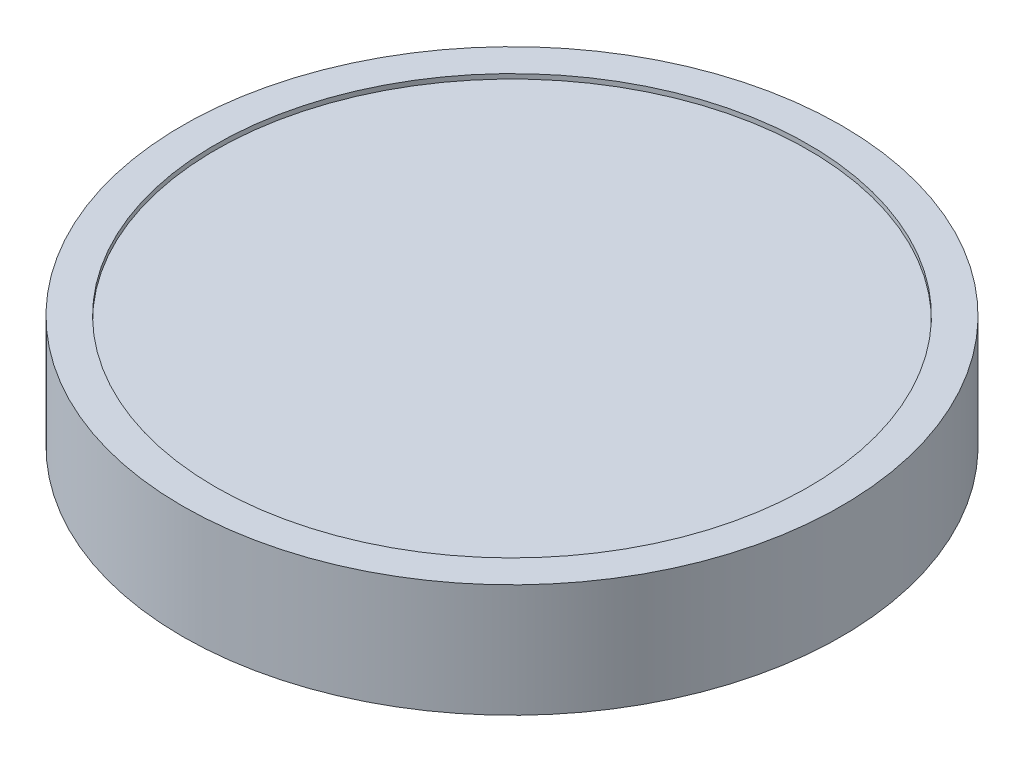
from build123d import *

# Parameters (mm, degrees)
CROQUIS1_R              = 70
SALIENTE_EXTRUIR1_DEPTH = 24
CROQUIS2_R              = 63
CORTAR_EXTRUIR1_DEPTH   = 1


with BuildPart() as part:
    # Croquis1 → Saliente-Extruir1 (new body)
    with BuildSketch(Plane(origin=(0, 0, 0), x_dir=(1, 0, 0), z_dir=(0, 1, 0))):
        with Locations(Location((0, 0, 0), (0, 0, 270))):
            Circle(CROQUIS1_R)
    extrude(amount=SALIENTE_EXTRUIR1_DEPTH)

    # Croquis2 → Cortar-Extruir1 (cut)
    with BuildSketch(Plane(origin=(0, 24, 0), x_dir=(1, 0, 0), z_dir=(0, 1, 0))):
        with Locations(Location((0, 0, 0), (0, 0, 270))):
            Circle(CROQUIS2_R)
    extrude(amount=-CORTAR_EXTRUIR1_DEPTH, mode=Mode.SUBTRACT)


solid = part.part
